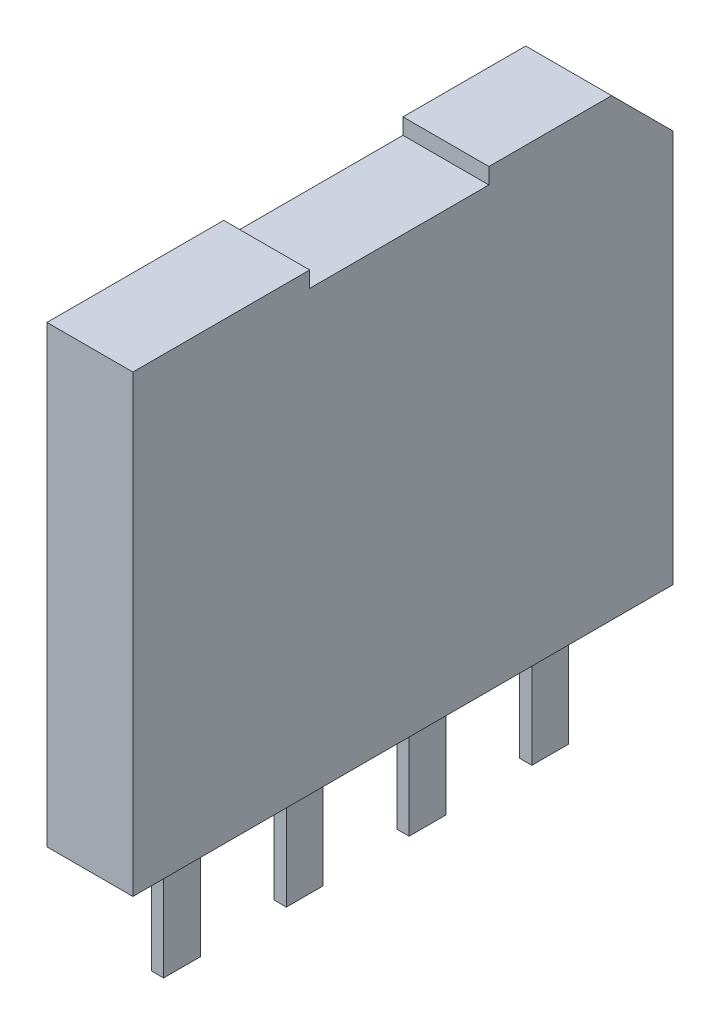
ISO-10303-21;
HEADER;
FILE_DESCRIPTION(('STEP AP214'),'2;1');
FILE_NAME('part.step','',(''),(''),'','','');
FILE_SCHEMA(('AUTOMOTIVE_DESIGN { 1 0 10303 214 1 1 1 1 }'));
ENDSEC;
DATA;
#1=APPLICATION_CONTEXT('core data for automotive mechanical design processes');
#2=APPLICATION_PROTOCOL_DEFINITION('international standard','automotive_design',2000,#1);
#3=PRODUCT_CONTEXT('',#1,'mechanical');
#4=PRODUCT('Part','Part','',(#3));
#5=PRODUCT_RELATED_PRODUCT_CATEGORY('part','',(#4));
#6=PRODUCT_DEFINITION_FORMATION('','',#4);
#7=PRODUCT_DEFINITION_CONTEXT('part definition',#1,'design');
#8=PRODUCT_DEFINITION('design','',#6,#7);
#9=PRODUCT_DEFINITION_SHAPE('','',#8);
#10=(LENGTH_UNIT() NAMED_UNIT(*) SI_UNIT(.MILLI.,.METRE.));
#11=(NAMED_UNIT(*) PLANE_ANGLE_UNIT() SI_UNIT($,.RADIAN.));
#12=(NAMED_UNIT(*) SI_UNIT($,.STERADIAN.) SOLID_ANGLE_UNIT());
#13=UNCERTAINTY_MEASURE_WITH_UNIT(LENGTH_MEASURE(1.E-05),#10,'distance_accuracy_value','');
#14=(GEOMETRIC_REPRESENTATION_CONTEXT(3) GLOBAL_UNCERTAINTY_ASSIGNED_CONTEXT((#13)) GLOBAL_UNIT_ASSIGNED_CONTEXT((#10,
#11,#12)) REPRESENTATION_CONTEXT('',''));
#15=CARTESIAN_POINT('',(0.,0.,0.));
#16=DIRECTION('',(0.,0.,1.));
#17=DIRECTION('',(1.,0.,0.));
#18=AXIS2_PLACEMENT_3D('',#15,#16,#17);
#19=CARTESIAN_POINT('',(1.75,0.,11.));
#20=DIRECTION('',(0.,0.,-1.));
#21=DIRECTION('',(-1.,0.,0.));
#22=AXIS2_PLACEMENT_3D('',#19,#20,#21);
#23=PLANE('',#22);
#24=DIRECTION('',(0.,-1.,0.));
#25=VECTOR('',#24,1.);
#26=CARTESIAN_POINT('',(-1.75,0.,11.));
#27=LINE('',#26,#25);
#28=CARTESIAN_POINT('',(-1.75,18.5,11.));
#29=VERTEX_POINT('',#28);
#30=CARTESIAN_POINT('',(-1.75,0.,11.));
#31=VERTEX_POINT('',#30);
#32=EDGE_CURVE('E11',#29,#31,#27,.T.);
#33=ORIENTED_EDGE('',*,*,#32,.T.);
#34=DIRECTION('',(-1.,0.,0.));
#35=VECTOR('',#34,1.);
#36=CARTESIAN_POINT('',(1.75,0.,11.));
#37=LINE('',#36,#35);
#38=CARTESIAN_POINT('',(1.75,0.,11.));
#39=VERTEX_POINT('',#38);
#40=EDGE_CURVE('E36',#39,#31,#37,.T.);
#41=ORIENTED_EDGE('',*,*,#40,.F.);
#42=DIRECTION('',(0.,-1.,0.));
#43=VECTOR('',#42,1.);
#44=CARTESIAN_POINT('',(1.75,0.,11.));
#45=LINE('',#44,#43);
#46=CARTESIAN_POINT('',(1.75,18.5,11.));
#47=VERTEX_POINT('',#46);
#48=EDGE_CURVE('E264',#47,#39,#45,.T.);
#49=ORIENTED_EDGE('',*,*,#48,.F.);
#50=DIRECTION('',(-1.,0.,0.));
#51=VECTOR('',#50,1.);
#52=CARTESIAN_POINT('',(1.75,18.5,11.));
#53=LINE('',#52,#51);
#54=EDGE_CURVE('E27',#47,#29,#53,.T.);
#55=ORIENTED_EDGE('',*,*,#54,.T.);
#56=EDGE_LOOP('',(#33,#41,#49,#55));
#57=FACE_BOUND('',#56,.T.);
#58=ADVANCED_FACE('F17',(#57),#23,.F.);
#59=CARTESIAN_POINT('',(1.75,0.,11.));
#60=DIRECTION('',(0.,1.,0.));
#61=DIRECTION('',(0.,0.,1.));
#62=AXIS2_PLACEMENT_3D('',#59,#60,#61);
#63=PLANE('',#62);
#64=DIRECTION('',(-1.,0.,0.));
#65=VECTOR('',#64,1.);
#66=CARTESIAN_POINT('',(0.25,0.,-6.75));
#67=LINE('',#66,#65);
#68=CARTESIAN_POINT('',(0.25,0.,-6.75));
#69=VERTEX_POINT('',#68);
#70=CARTESIAN_POINT('',(-0.25,0.,-6.75));
#71=VERTEX_POINT('',#70);
#72=EDGE_CURVE('E210',#69,#71,#67,.T.);
#73=ORIENTED_EDGE('',*,*,#72,.F.);
#74=DIRECTION('',(0.,0.,1.));
#75=VECTOR('',#74,1.);
#76=CARTESIAN_POINT('',(0.25,0.,-6.75));
#77=LINE('',#76,#75);
#78=CARTESIAN_POINT('',(0.25,0.,-8.25));
#79=VERTEX_POINT('',#78);
#80=EDGE_CURVE('E205',#79,#69,#77,.T.);
#81=ORIENTED_EDGE('',*,*,#80,.F.);
#82=DIRECTION('',(-1.,0.,0.));
#83=VECTOR('',#82,1.);
#84=CARTESIAN_POINT('',(0.25,0.,-8.25));
#85=LINE('',#84,#83);
#86=CARTESIAN_POINT('',(-0.25,0.,-8.25));
#87=VERTEX_POINT('',#86);
#88=EDGE_CURVE('E204',#79,#87,#85,.T.);
#89=ORIENTED_EDGE('',*,*,#88,.T.);
#90=DIRECTION('',(0.,0.,1.));
#91=VECTOR('',#90,1.);
#92=CARTESIAN_POINT('',(-0.25,0.,-6.75));
#93=LINE('',#92,#91);
#94=EDGE_CURVE('E213',#87,#71,#93,.T.);
#95=ORIENTED_EDGE('',*,*,#94,.T.);
#96=EDGE_LOOP('',(#73,#81,#89,#95));
#97=FACE_BOUND('',#96,.T.);
#98=DIRECTION('',(-1.,0.,0.));
#99=VECTOR('',#98,1.);
#100=CARTESIAN_POINT('',(0.25,0.,-1.75));
#101=LINE('',#100,#99);
#102=CARTESIAN_POINT('',(0.25,0.,-1.75));
#103=VERTEX_POINT('',#102);
#104=CARTESIAN_POINT('',(-0.25,0.,-1.75));
#105=VERTEX_POINT('',#104);
#106=EDGE_CURVE('E217',#103,#105,#101,.T.);
#107=ORIENTED_EDGE('',*,*,#106,.F.);
#108=DIRECTION('',(0.,0.,1.));
#109=VECTOR('',#108,1.);
#110=CARTESIAN_POINT('',(0.25,0.,-1.75));
#111=LINE('',#110,#109);
#112=CARTESIAN_POINT('',(0.25,0.,-3.25));
#113=VERTEX_POINT('',#112);
#114=EDGE_CURVE('E221',#113,#103,#111,.T.);
#115=ORIENTED_EDGE('',*,*,#114,.F.);
#116=DIRECTION('',(-1.,0.,0.));
#117=VECTOR('',#116,1.);
#118=CARTESIAN_POINT('',(0.25,0.,-3.25));
#119=LINE('',#118,#117);
#120=CARTESIAN_POINT('',(-0.25,0.,-3.25));
#121=VERTEX_POINT('',#120);
#122=EDGE_CURVE('E216',#113,#121,#119,.T.);
#123=ORIENTED_EDGE('',*,*,#122,.T.);
#124=DIRECTION('',(0.,0.,1.));
#125=VECTOR('',#124,1.);
#126=CARTESIAN_POINT('',(-0.25,0.,-1.75));
#127=LINE('',#126,#125);
#128=EDGE_CURVE('E227',#121,#105,#127,.T.);
#129=ORIENTED_EDGE('',*,*,#128,.T.);
#130=EDGE_LOOP('',(#107,#115,#123,#129));
#131=FACE_BOUND('',#130,.T.);
#132=DIRECTION('',(-1.,0.,0.));
#133=VECTOR('',#132,1.);
#134=CARTESIAN_POINT('',(0.25,0.,3.25));
#135=LINE('',#134,#133);
#136=CARTESIAN_POINT('',(0.25,0.,3.25));
#137=VERTEX_POINT('',#136);
#138=CARTESIAN_POINT('',(-0.25,0.,3.25));
#139=VERTEX_POINT('',#138);
#140=EDGE_CURVE('E231',#137,#139,#135,.T.);
#141=ORIENTED_EDGE('',*,*,#140,.F.);
#142=DIRECTION('',(0.,0.,1.));
#143=VECTOR('',#142,1.);
#144=CARTESIAN_POINT('',(0.25,0.,3.25));
#145=LINE('',#144,#143);
#146=CARTESIAN_POINT('',(0.25,0.,1.75));
#147=VERTEX_POINT('',#146);
#148=EDGE_CURVE('E235',#147,#137,#145,.T.);
#149=ORIENTED_EDGE('',*,*,#148,.F.);
#150=DIRECTION('',(-1.,0.,0.));
#151=VECTOR('',#150,1.);
#152=CARTESIAN_POINT('',(0.25,0.,1.75));
#153=LINE('',#152,#151);
#154=CARTESIAN_POINT('',(-0.25,0.,1.75));
#155=VERTEX_POINT('',#154);
#156=EDGE_CURVE('E230',#147,#155,#153,.T.);
#157=ORIENTED_EDGE('',*,*,#156,.T.);
#158=DIRECTION('',(0.,0.,1.));
#159=VECTOR('',#158,1.);
#160=CARTESIAN_POINT('',(-0.25,0.,3.25));
#161=LINE('',#160,#159);
#162=EDGE_CURVE('E240',#155,#139,#161,.T.);
#163=ORIENTED_EDGE('',*,*,#162,.T.);
#164=EDGE_LOOP('',(#141,#149,#157,#163));
#165=FACE_BOUND('',#164,.T.);
#166=DIRECTION('',(-1.,0.,0.));
#167=VECTOR('',#166,1.);
#168=CARTESIAN_POINT('',(0.25,0.,8.25));
#169=LINE('',#168,#167);
#170=CARTESIAN_POINT('',(0.25,0.,8.25));
#171=VERTEX_POINT('',#170);
#172=CARTESIAN_POINT('',(-0.25,0.,8.25));
#173=VERTEX_POINT('',#172);
#174=EDGE_CURVE('E244',#171,#173,#169,.T.);
#175=ORIENTED_EDGE('',*,*,#174,.F.);
#176=DIRECTION('',(0.,0.,1.));
#177=VECTOR('',#176,1.);
#178=CARTESIAN_POINT('',(0.25,0.,8.25));
#179=LINE('',#178,#177);
#180=CARTESIAN_POINT('',(0.25,0.,6.75));
#181=VERTEX_POINT('',#180);
#182=EDGE_CURVE('E248',#181,#171,#179,.T.);
#183=ORIENTED_EDGE('',*,*,#182,.F.);
#184=DIRECTION('',(-1.,0.,0.));
#185=VECTOR('',#184,1.);
#186=CARTESIAN_POINT('',(0.25,0.,6.75));
#187=LINE('',#186,#185);
#188=CARTESIAN_POINT('',(-0.25,0.,6.75));
#189=VERTEX_POINT('',#188);
#190=EDGE_CURVE('E243',#181,#189,#187,.T.);
#191=ORIENTED_EDGE('',*,*,#190,.T.);
#192=DIRECTION('',(0.,0.,1.));
#193=VECTOR('',#192,1.);
#194=CARTESIAN_POINT('',(-0.25,0.,8.25));
#195=LINE('',#194,#193);
#196=EDGE_CURVE('E253',#189,#173,#195,.T.);
#197=ORIENTED_EDGE('',*,*,#196,.T.);
#198=EDGE_LOOP('',(#175,#183,#191,#197));
#199=FACE_BOUND('',#198,.T.);
#200=DIRECTION('',(0.,0.,-1.));
#201=VECTOR('',#200,1.);
#202=CARTESIAN_POINT('',(-1.75,0.,11.));
#203=LINE('',#202,#201);
#204=CARTESIAN_POINT('',(-1.75,0.,-11.));
#205=VERTEX_POINT('',#204);
#206=EDGE_CURVE('E256',#31,#205,#203,.T.);
#207=ORIENTED_EDGE('',*,*,#206,.T.);
#208=DIRECTION('',(-1.,0.,0.));
#209=VECTOR('',#208,1.);
#210=CARTESIAN_POINT('',(1.75,0.,-11.));
#211=LINE('',#210,#209);
#212=CARTESIAN_POINT('',(1.75,0.,-11.));
#213=VERTEX_POINT('',#212);
#214=EDGE_CURVE('E258',#213,#205,#211,.T.);
#215=ORIENTED_EDGE('',*,*,#214,.F.);
#216=DIRECTION('',(0.,0.,-1.));
#217=VECTOR('',#216,1.);
#218=CARTESIAN_POINT('',(1.75,0.,11.));
#219=LINE('',#218,#217);
#220=EDGE_CURVE('E262',#39,#213,#219,.T.);
#221=ORIENTED_EDGE('',*,*,#220,.F.);
#222=ORIENTED_EDGE('',*,*,#40,.T.);
#223=EDGE_LOOP('',(#207,#215,#221,#222));
#224=FACE_BOUND('',#223,.T.);
#225=ADVANCED_FACE('F370',(#97,#131,#165,#199,#224),#63,.F.);
#226=CARTESIAN_POINT('',(1.75,0.,-11.));
#227=DIRECTION('',(0.,0.,1.));
#228=DIRECTION('',(1.,0.,0.));
#229=AXIS2_PLACEMENT_3D('',#226,#227,#228);
#230=PLANE('',#229);
#231=DIRECTION('',(0.,1.,0.));
#232=VECTOR('',#231,1.);
#233=CARTESIAN_POINT('',(-1.75,0.,-11.));
#234=LINE('',#233,#232);
#235=CARTESIAN_POINT('',(-1.75,16.,-11.));
#236=VERTEX_POINT('',#235);
#237=EDGE_CURVE('E260',#205,#236,#234,.T.);
#238=ORIENTED_EDGE('',*,*,#237,.T.);
#239=DIRECTION('',(-1.,0.,0.));
#240=VECTOR('',#239,1.);
#241=CARTESIAN_POINT('',(1.75,16.,-11.));
#242=LINE('',#241,#240);
#243=CARTESIAN_POINT('',(1.75,16.,-11.));
#244=VERTEX_POINT('',#243);
#245=EDGE_CURVE('E268',#244,#236,#242,.T.);
#246=ORIENTED_EDGE('',*,*,#245,.F.);
#247=DIRECTION('',(0.,1.,0.));
#248=VECTOR('',#247,1.);
#249=CARTESIAN_POINT('',(1.75,0.,-11.));
#250=LINE('',#249,#248);
#251=EDGE_CURVE('E265',#213,#244,#250,.T.);
#252=ORIENTED_EDGE('',*,*,#251,.F.);
#253=ORIENTED_EDGE('',*,*,#214,.T.);
#254=EDGE_LOOP('',(#238,#246,#252,#253));
#255=FACE_BOUND('',#254,.T.);
#256=ADVANCED_FACE('F392',(#255),#230,.F.);
#257=CARTESIAN_POINT('',(1.75,18.5,-8.5));
#258=DIRECTION('',(0.,-0.707106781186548,0.707106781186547));
#259=DIRECTION('',(0.,-0.707106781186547,-0.707106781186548));
#260=AXIS2_PLACEMENT_3D('',#257,#258,#259);
#261=PLANE('',#260);
#262=DIRECTION('',(0.,0.707106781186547,0.707106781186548));
#263=VECTOR('',#262,1.);
#264=CARTESIAN_POINT('',(-1.75,18.5,-8.5));
#265=LINE('',#264,#263);
#266=CARTESIAN_POINT('',(-1.75,18.5,-8.5));
#267=VERTEX_POINT('',#266);
#268=EDGE_CURVE('E261',#236,#267,#265,.T.);
#269=ORIENTED_EDGE('',*,*,#268,.T.);
#270=DIRECTION('',(-1.,0.,0.));
#271=VECTOR('',#270,1.);
#272=CARTESIAN_POINT('',(1.75,18.5,-8.5));
#273=LINE('',#272,#271);
#274=CARTESIAN_POINT('',(1.75,18.5,-8.5));
#275=VERTEX_POINT('',#274);
#276=EDGE_CURVE('E275',#275,#267,#273,.T.);
#277=ORIENTED_EDGE('',*,*,#276,.F.);
#278=DIRECTION('',(0.,0.707106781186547,0.707106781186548));
#279=VECTOR('',#278,1.);
#280=CARTESIAN_POINT('',(1.75,18.5,-8.5));
#281=LINE('',#280,#279);
#282=EDGE_CURVE('E272',#244,#275,#281,.T.);
#283=ORIENTED_EDGE('',*,*,#282,.F.);
#284=ORIENTED_EDGE('',*,*,#245,.T.);
#285=EDGE_LOOP('',(#269,#277,#283,#284));
#286=FACE_BOUND('',#285,.T.);
#287=ADVANCED_FACE('F397',(#286),#261,.F.);
#288=CARTESIAN_POINT('',(1.75,18.5,-3.5));
#289=DIRECTION('',(0.,-1.,0.));
#290=DIRECTION('',(0.,0.,-1.));
#291=AXIS2_PLACEMENT_3D('',#288,#289,#290);
#292=PLANE('',#291);
#293=DIRECTION('',(0.,0.,1.));
#294=VECTOR('',#293,1.);
#295=CARTESIAN_POINT('',(-1.75,18.5,-3.5));
#296=LINE('',#295,#294);
#297=CARTESIAN_POINT('',(-1.75,18.5,-3.5));
#298=VERTEX_POINT('',#297);
#299=EDGE_CURVE('E270',#267,#298,#296,.T.);
#300=ORIENTED_EDGE('',*,*,#299,.T.);
#301=DIRECTION('',(-1.,0.,0.));
#302=VECTOR('',#301,1.);
#303=CARTESIAN_POINT('',(1.75,18.5,-3.5));
#304=LINE('',#303,#302);
#305=CARTESIAN_POINT('',(1.75,18.5,-3.5));
#306=VERTEX_POINT('',#305);
#307=EDGE_CURVE('E282',#306,#298,#304,.T.);
#308=ORIENTED_EDGE('',*,*,#307,.F.);
#309=DIRECTION('',(0.,0.,1.));
#310=VECTOR('',#309,1.);
#311=CARTESIAN_POINT('',(1.75,18.5,-3.5));
#312=LINE('',#311,#310);
#313=EDGE_CURVE('E279',#275,#306,#312,.T.);
#314=ORIENTED_EDGE('',*,*,#313,.F.);
#315=ORIENTED_EDGE('',*,*,#276,.T.);
#316=EDGE_LOOP('',(#300,#308,#314,#315));
#317=FACE_BOUND('',#316,.T.);
#318=ADVANCED_FACE('F401',(#317),#292,.F.);
#319=CARTESIAN_POINT('',(1.75,17.85,-3.5));
#320=DIRECTION('',(0.,0.,-1.));
#321=DIRECTION('',(-1.,0.,0.));
#322=AXIS2_PLACEMENT_3D('',#319,#320,#321);
#323=PLANE('',#322);
#324=DIRECTION('',(0.,-1.,0.));
#325=VECTOR('',#324,1.);
#326=CARTESIAN_POINT('',(-1.75,17.85,-3.5));
#327=LINE('',#326,#325);
#328=CARTESIAN_POINT('',(-1.75,17.85,-3.5));
#329=VERTEX_POINT('',#328);
#330=EDGE_CURVE('E277',#298,#329,#327,.T.);
#331=ORIENTED_EDGE('',*,*,#330,.T.);
#332=DIRECTION('',(-1.,0.,0.));
#333=VECTOR('',#332,1.);
#334=CARTESIAN_POINT('',(1.75,17.85,-3.5));
#335=LINE('',#334,#333);
#336=CARTESIAN_POINT('',(1.75,17.85,-3.5));
#337=VERTEX_POINT('',#336);
#338=EDGE_CURVE('E289',#337,#329,#335,.T.);
#339=ORIENTED_EDGE('',*,*,#338,.F.);
#340=DIRECTION('',(0.,-1.,0.));
#341=VECTOR('',#340,1.);
#342=CARTESIAN_POINT('',(1.75,17.85,-3.5));
#343=LINE('',#342,#341);
#344=EDGE_CURVE('E286',#306,#337,#343,.T.);
#345=ORIENTED_EDGE('',*,*,#344,.F.);
#346=ORIENTED_EDGE('',*,*,#307,.T.);
#347=EDGE_LOOP('',(#331,#339,#345,#346));
#348=FACE_BOUND('',#347,.T.);
#349=ADVANCED_FACE('F405',(#348),#323,.F.);
#350=CARTESIAN_POINT('',(1.75,17.85,3.8));
#351=DIRECTION('',(0.,-1.,0.));
#352=DIRECTION('',(0.,0.,-1.));
#353=AXIS2_PLACEMENT_3D('',#350,#351,#352);
#354=PLANE('',#353);
#355=DIRECTION('',(0.,0.,1.));
#356=VECTOR('',#355,1.);
#357=CARTESIAN_POINT('',(-1.75,17.85,3.8));
#358=LINE('',#357,#356);
#359=CARTESIAN_POINT('',(-1.75,17.85,3.8));
#360=VERTEX_POINT('',#359);
#361=EDGE_CURVE('E284',#329,#360,#358,.T.);
#362=ORIENTED_EDGE('',*,*,#361,.T.);
#363=DIRECTION('',(-1.,0.,0.));
#364=VECTOR('',#363,1.);
#365=CARTESIAN_POINT('',(1.75,17.85,3.8));
#366=LINE('',#365,#364);
#367=CARTESIAN_POINT('',(1.75,17.85,3.8));
#368=VERTEX_POINT('',#367);
#369=EDGE_CURVE('E296',#368,#360,#366,.T.);
#370=ORIENTED_EDGE('',*,*,#369,.F.);
#371=DIRECTION('',(0.,0.,1.));
#372=VECTOR('',#371,1.);
#373=CARTESIAN_POINT('',(1.75,17.85,3.8));
#374=LINE('',#373,#372);
#375=EDGE_CURVE('E293',#337,#368,#374,.T.);
#376=ORIENTED_EDGE('',*,*,#375,.F.);
#377=ORIENTED_EDGE('',*,*,#338,.T.);
#378=EDGE_LOOP('',(#362,#370,#376,#377));
#379=FACE_BOUND('',#378,.T.);
#380=ADVANCED_FACE('F409',(#379),#354,.F.);
#381=CARTESIAN_POINT('',(1.75,18.5,3.8));
#382=DIRECTION('',(0.,0.,1.));
#383=DIRECTION('',(0.,-1.,0.));
#384=AXIS2_PLACEMENT_3D('',#381,#382,#383);
#385=PLANE('',#384);
#386=DIRECTION('',(0.,1.,0.));
#387=VECTOR('',#386,1.);
#388=CARTESIAN_POINT('',(-1.75,18.5,3.8));
#389=LINE('',#388,#387);
#390=CARTESIAN_POINT('',(-1.75,18.5,3.8));
#391=VERTEX_POINT('',#390);
#392=EDGE_CURVE('E291',#360,#391,#389,.T.);
#393=ORIENTED_EDGE('',*,*,#392,.T.);
#394=DIRECTION('',(-1.,0.,0.));
#395=VECTOR('',#394,1.);
#396=CARTESIAN_POINT('',(1.75,18.5,3.8));
#397=LINE('',#396,#395);
#398=CARTESIAN_POINT('',(1.75,18.5,3.8));
#399=VERTEX_POINT('',#398);
#400=EDGE_CURVE('E303',#399,#391,#397,.T.);
#401=ORIENTED_EDGE('',*,*,#400,.F.);
#402=DIRECTION('',(0.,1.,0.));
#403=VECTOR('',#402,1.);
#404=CARTESIAN_POINT('',(1.75,18.5,3.8));
#405=LINE('',#404,#403);
#406=EDGE_CURVE('E300',#368,#399,#405,.T.);
#407=ORIENTED_EDGE('',*,*,#406,.F.);
#408=ORIENTED_EDGE('',*,*,#369,.T.);
#409=EDGE_LOOP('',(#393,#401,#407,#408));
#410=FACE_BOUND('',#409,.T.);
#411=ADVANCED_FACE('F413',(#410),#385,.F.);
#412=CARTESIAN_POINT('',(1.75,18.5,11.));
#413=DIRECTION('',(0.,-1.,0.));
#414=DIRECTION('',(0.,0.,-1.));
#415=AXIS2_PLACEMENT_3D('',#412,#413,#414);
#416=PLANE('',#415);
#417=DIRECTION('',(0.,0.,1.));
#418=VECTOR('',#417,1.);
#419=CARTESIAN_POINT('',(-1.75,18.5,11.));
#420=LINE('',#419,#418);
#421=EDGE_CURVE('E298',#391,#29,#420,.T.);
#422=ORIENTED_EDGE('',*,*,#421,.T.);
#423=ORIENTED_EDGE('',*,*,#54,.F.);
#424=DIRECTION('',(0.,0.,1.));
#425=VECTOR('',#424,1.);
#426=CARTESIAN_POINT('',(1.75,18.5,11.));
#427=LINE('',#426,#425);
#428=EDGE_CURVE('E306',#399,#47,#427,.T.);
#429=ORIENTED_EDGE('',*,*,#428,.F.);
#430=ORIENTED_EDGE('',*,*,#400,.T.);
#431=EDGE_LOOP('',(#422,#423,#429,#430));
#432=FACE_BOUND('',#431,.T.);
#433=ADVANCED_FACE('F417',(#432),#416,.F.);
#434=CARTESIAN_POINT('',(1.75,18.5,11.));
#435=DIRECTION('',(-1.,0.,0.));
#436=DIRECTION('',(0.,0.,1.));
#437=AXIS2_PLACEMENT_3D('',#434,#435,#436);
#438=PLANE('',#437);
#439=ORIENTED_EDGE('',*,*,#48,.T.);
#440=ORIENTED_EDGE('',*,*,#220,.T.);
#441=ORIENTED_EDGE('',*,*,#251,.T.);
#442=ORIENTED_EDGE('',*,*,#282,.T.);
#443=ORIENTED_EDGE('',*,*,#313,.T.);
#444=ORIENTED_EDGE('',*,*,#344,.T.);
#445=ORIENTED_EDGE('',*,*,#375,.T.);
#446=ORIENTED_EDGE('',*,*,#406,.T.);
#447=ORIENTED_EDGE('',*,*,#428,.T.);
#448=EDGE_LOOP('',(#439,#440,#441,#442,#443,#444,#445,#446,#447));
#449=FACE_BOUND('',#448,.T.);
#450=ADVANCED_FACE('F421',(#449),#438,.F.);
#451=CARTESIAN_POINT('',(-1.75,18.5,11.));
#452=DIRECTION('',(-1.,0.,0.));
#453=DIRECTION('',(0.,0.,1.));
#454=AXIS2_PLACEMENT_3D('',#451,#452,#453);
#455=PLANE('',#454);
#456=ORIENTED_EDGE('',*,*,#32,.F.);
#457=ORIENTED_EDGE('',*,*,#421,.F.);
#458=ORIENTED_EDGE('',*,*,#392,.F.);
#459=ORIENTED_EDGE('',*,*,#361,.F.);
#460=ORIENTED_EDGE('',*,*,#330,.F.);
#461=ORIENTED_EDGE('',*,*,#299,.F.);
#462=ORIENTED_EDGE('',*,*,#268,.F.);
#463=ORIENTED_EDGE('',*,*,#237,.F.);
#464=ORIENTED_EDGE('',*,*,#206,.F.);
#465=EDGE_LOOP('',(#456,#457,#458,#459,#460,#461,#462,#463,#464));
#466=FACE_BOUND('',#465,.T.);
#467=ADVANCED_FACE('F425',(#466),#455,.T.);
#468=CARTESIAN_POINT('',(0.25,0.,8.25));
#469=DIRECTION('',(0.,0.,-1.));
#470=DIRECTION('',(0.,1.,0.));
#471=AXIS2_PLACEMENT_3D('',#468,#469,#470);
#472=PLANE('',#471);
#473=DIRECTION('',(0.,-1.,0.));
#474=VECTOR('',#473,1.);
#475=CARTESIAN_POINT('',(-0.25,0.,8.25));
#476=LINE('',#475,#474);
#477=CARTESIAN_POINT('',(-0.25,-5.,8.25));
#478=VERTEX_POINT('',#477);
#479=EDGE_CURVE('E246',#173,#478,#476,.T.);
#480=ORIENTED_EDGE('',*,*,#479,.T.);
#481=DIRECTION('',(-1.,0.,0.));
#482=VECTOR('',#481,1.);
#483=CARTESIAN_POINT('',(0.25,-5.,8.25));
#484=LINE('',#483,#482);
#485=CARTESIAN_POINT('',(0.25,-5.,8.25));
#486=VERTEX_POINT('',#485);
#487=EDGE_CURVE('E313',#486,#478,#484,.T.);
#488=ORIENTED_EDGE('',*,*,#487,.F.);
#489=DIRECTION('',(0.,-1.,0.));
#490=VECTOR('',#489,1.);
#491=CARTESIAN_POINT('',(0.25,0.,8.25));
#492=LINE('',#491,#490);
#493=EDGE_CURVE('E316',#171,#486,#492,.T.);
#494=ORIENTED_EDGE('',*,*,#493,.F.);
#495=ORIENTED_EDGE('',*,*,#174,.T.);
#496=EDGE_LOOP('',(#480,#488,#494,#495));
#497=FACE_BOUND('',#496,.T.);
#498=ADVANCED_FACE('F429',(#497),#472,.F.);
#499=CARTESIAN_POINT('',(0.25,-5.,8.25));
#500=DIRECTION('',(0.,1.,0.));
#501=DIRECTION('',(0.,0.,1.));
#502=AXIS2_PLACEMENT_3D('',#499,#500,#501);
#503=PLANE('',#502);
#504=DIRECTION('',(0.,0.,-1.));
#505=VECTOR('',#504,1.);
#506=CARTESIAN_POINT('',(-0.25,-5.,8.25));
#507=LINE('',#506,#505);
#508=CARTESIAN_POINT('',(-0.25,-5.,6.75));
#509=VERTEX_POINT('',#508);
#510=EDGE_CURVE('E247',#478,#509,#507,.T.);
#511=ORIENTED_EDGE('',*,*,#510,.T.);
#512=DIRECTION('',(-1.,0.,0.));
#513=VECTOR('',#512,1.);
#514=CARTESIAN_POINT('',(0.25,-5.,6.75));
#515=LINE('',#514,#513);
#516=CARTESIAN_POINT('',(0.25,-5.,6.75));
#517=VERTEX_POINT('',#516);
#518=EDGE_CURVE('E318',#517,#509,#515,.T.);
#519=ORIENTED_EDGE('',*,*,#518,.F.);
#520=DIRECTION('',(0.,0.,-1.));
#521=VECTOR('',#520,1.);
#522=CARTESIAN_POINT('',(0.25,-5.,8.25));
#523=LINE('',#522,#521);
#524=EDGE_CURVE('E319',#486,#517,#523,.T.);
#525=ORIENTED_EDGE('',*,*,#524,.F.);
#526=ORIENTED_EDGE('',*,*,#487,.T.);
#527=EDGE_LOOP('',(#511,#519,#525,#526));
#528=FACE_BOUND('',#527,.T.);
#529=ADVANCED_FACE('F433',(#528),#503,.F.);
#530=CARTESIAN_POINT('',(0.25,0.,6.75));
#531=DIRECTION('',(0.,0.,1.));
#532=DIRECTION('',(0.,-1.,0.));
#533=AXIS2_PLACEMENT_3D('',#530,#531,#532);
#534=PLANE('',#533);
#535=DIRECTION('',(0.,1.,0.));
#536=VECTOR('',#535,1.);
#537=CARTESIAN_POINT('',(-0.25,0.,6.75));
#538=LINE('',#537,#536);
#539=EDGE_CURVE('E315',#509,#189,#538,.T.);
#540=ORIENTED_EDGE('',*,*,#539,.T.);
#541=ORIENTED_EDGE('',*,*,#190,.F.);
#542=DIRECTION('',(0.,1.,0.));
#543=VECTOR('',#542,1.);
#544=CARTESIAN_POINT('',(0.25,0.,6.75));
#545=LINE('',#544,#543);
#546=EDGE_CURVE('E250',#517,#181,#545,.T.);
#547=ORIENTED_EDGE('',*,*,#546,.F.);
#548=ORIENTED_EDGE('',*,*,#518,.T.);
#549=EDGE_LOOP('',(#540,#541,#547,#548));
#550=FACE_BOUND('',#549,.T.);
#551=ADVANCED_FACE('F437',(#550),#534,.F.);
#552=CARTESIAN_POINT('',(0.25,0.,8.25));
#553=DIRECTION('',(1.,0.,0.));
#554=DIRECTION('',(0.,0.,-1.));
#555=AXIS2_PLACEMENT_3D('',#552,#553,#554);
#556=PLANE('',#555);
#557=ORIENTED_EDGE('',*,*,#493,.T.);
#558=ORIENTED_EDGE('',*,*,#524,.T.);
#559=ORIENTED_EDGE('',*,*,#546,.T.);
#560=ORIENTED_EDGE('',*,*,#182,.T.);
#561=EDGE_LOOP('',(#557,#558,#559,#560));
#562=FACE_BOUND('',#561,.T.);
#563=ADVANCED_FACE('F441',(#562),#556,.T.);
#564=CARTESIAN_POINT('',(-0.25,0.,8.25));
#565=DIRECTION('',(1.,0.,0.));
#566=DIRECTION('',(0.,0.,-1.));
#567=AXIS2_PLACEMENT_3D('',#564,#565,#566);
#568=PLANE('',#567);
#569=ORIENTED_EDGE('',*,*,#479,.F.);
#570=ORIENTED_EDGE('',*,*,#196,.F.);
#571=ORIENTED_EDGE('',*,*,#539,.F.);
#572=ORIENTED_EDGE('',*,*,#510,.F.);
#573=EDGE_LOOP('',(#569,#570,#571,#572));
#574=FACE_BOUND('',#573,.T.);
#575=ADVANCED_FACE('F445',(#574),#568,.F.);
#576=CARTESIAN_POINT('',(0.25,0.,3.25));
#577=DIRECTION('',(0.,0.,-1.));
#578=DIRECTION('',(0.,1.,0.));
#579=AXIS2_PLACEMENT_3D('',#576,#577,#578);
#580=PLANE('',#579);
#581=DIRECTION('',(0.,-1.,0.));
#582=VECTOR('',#581,1.);
#583=CARTESIAN_POINT('',(-0.25,0.,3.25));
#584=LINE('',#583,#582);
#585=CARTESIAN_POINT('',(-0.25,-5.,3.25));
#586=VERTEX_POINT('',#585);
#587=EDGE_CURVE('E233',#139,#586,#584,.T.);
#588=ORIENTED_EDGE('',*,*,#587,.T.);
#589=DIRECTION('',(-1.,0.,0.));
#590=VECTOR('',#589,1.);
#591=CARTESIAN_POINT('',(0.25,-5.,3.25));
#592=LINE('',#591,#590);
#593=CARTESIAN_POINT('',(0.25,-5.,3.25));
#594=VERTEX_POINT('',#593);
#595=EDGE_CURVE('E330',#594,#586,#592,.T.);
#596=ORIENTED_EDGE('',*,*,#595,.F.);
#597=DIRECTION('',(0.,-1.,0.));
#598=VECTOR('',#597,1.);
#599=CARTESIAN_POINT('',(0.25,0.,3.25));
#600=LINE('',#599,#598);
#601=EDGE_CURVE('E333',#137,#594,#600,.T.);
#602=ORIENTED_EDGE('',*,*,#601,.F.);
#603=ORIENTED_EDGE('',*,*,#140,.T.);
#604=EDGE_LOOP('',(#588,#596,#602,#603));
#605=FACE_BOUND('',#604,.T.);
#606=ADVANCED_FACE('F449',(#605),#580,.F.);
#607=CARTESIAN_POINT('',(0.25,-5.,3.25));
#608=DIRECTION('',(0.,1.,0.));
#609=DIRECTION('',(0.,0.,1.));
#610=AXIS2_PLACEMENT_3D('',#607,#608,#609);
#611=PLANE('',#610);
#612=DIRECTION('',(0.,0.,-1.));
#613=VECTOR('',#612,1.);
#614=CARTESIAN_POINT('',(-0.25,-5.,3.25));
#615=LINE('',#614,#613);
#616=CARTESIAN_POINT('',(-0.25,-5.,1.75));
#617=VERTEX_POINT('',#616);
#618=EDGE_CURVE('E234',#586,#617,#615,.T.);
#619=ORIENTED_EDGE('',*,*,#618,.T.);
#620=DIRECTION('',(-1.,0.,0.));
#621=VECTOR('',#620,1.);
#622=CARTESIAN_POINT('',(0.25,-5.,1.75));
#623=LINE('',#622,#621);
#624=CARTESIAN_POINT('',(0.25,-5.,1.75));
#625=VERTEX_POINT('',#624);
#626=EDGE_CURVE('E335',#625,#617,#623,.T.);
#627=ORIENTED_EDGE('',*,*,#626,.F.);
#628=DIRECTION('',(0.,0.,-1.));
#629=VECTOR('',#628,1.);
#630=CARTESIAN_POINT('',(0.25,-5.,3.25));
#631=LINE('',#630,#629);
#632=EDGE_CURVE('E336',#594,#625,#631,.T.);
#633=ORIENTED_EDGE('',*,*,#632,.F.);
#634=ORIENTED_EDGE('',*,*,#595,.T.);
#635=EDGE_LOOP('',(#619,#627,#633,#634));
#636=FACE_BOUND('',#635,.T.);
#637=ADVANCED_FACE('F453',(#636),#611,.F.);
#638=CARTESIAN_POINT('',(0.25,0.,1.75));
#639=DIRECTION('',(0.,0.,1.));
#640=DIRECTION('',(0.,-1.,0.));
#641=AXIS2_PLACEMENT_3D('',#638,#639,#640);
#642=PLANE('',#641);
#643=DIRECTION('',(0.,1.,0.));
#644=VECTOR('',#643,1.);
#645=CARTESIAN_POINT('',(-0.25,0.,1.75));
#646=LINE('',#645,#644);
#647=EDGE_CURVE('E332',#617,#155,#646,.T.);
#648=ORIENTED_EDGE('',*,*,#647,.T.);
#649=ORIENTED_EDGE('',*,*,#156,.F.);
#650=DIRECTION('',(0.,1.,0.));
#651=VECTOR('',#650,1.);
#652=CARTESIAN_POINT('',(0.25,0.,1.75));
#653=LINE('',#652,#651);
#654=EDGE_CURVE('E237',#625,#147,#653,.T.);
#655=ORIENTED_EDGE('',*,*,#654,.F.);
#656=ORIENTED_EDGE('',*,*,#626,.T.);
#657=EDGE_LOOP('',(#648,#649,#655,#656));
#658=FACE_BOUND('',#657,.T.);
#659=ADVANCED_FACE('F457',(#658),#642,.F.);
#660=CARTESIAN_POINT('',(0.25,0.,3.25));
#661=DIRECTION('',(1.,0.,0.));
#662=DIRECTION('',(0.,0.,-1.));
#663=AXIS2_PLACEMENT_3D('',#660,#661,#662);
#664=PLANE('',#663);
#665=ORIENTED_EDGE('',*,*,#601,.T.);
#666=ORIENTED_EDGE('',*,*,#632,.T.);
#667=ORIENTED_EDGE('',*,*,#654,.T.);
#668=ORIENTED_EDGE('',*,*,#148,.T.);
#669=EDGE_LOOP('',(#665,#666,#667,#668));
#670=FACE_BOUND('',#669,.T.);
#671=ADVANCED_FACE('F461',(#670),#664,.T.);
#672=CARTESIAN_POINT('',(-0.25,0.,3.25));
#673=DIRECTION('',(1.,0.,0.));
#674=DIRECTION('',(0.,0.,-1.));
#675=AXIS2_PLACEMENT_3D('',#672,#673,#674);
#676=PLANE('',#675);
#677=ORIENTED_EDGE('',*,*,#587,.F.);
#678=ORIENTED_EDGE('',*,*,#162,.F.);
#679=ORIENTED_EDGE('',*,*,#647,.F.);
#680=ORIENTED_EDGE('',*,*,#618,.F.);
#681=EDGE_LOOP('',(#677,#678,#679,#680));
#682=FACE_BOUND('',#681,.T.);
#683=ADVANCED_FACE('F465',(#682),#676,.F.);
#684=CARTESIAN_POINT('',(0.25,0.,-1.75));
#685=DIRECTION('',(0.,0.,-1.));
#686=DIRECTION('',(0.,1.,0.));
#687=AXIS2_PLACEMENT_3D('',#684,#685,#686);
#688=PLANE('',#687);
#689=DIRECTION('',(0.,-1.,0.));
#690=VECTOR('',#689,1.);
#691=CARTESIAN_POINT('',(-0.25,0.,-1.75));
#692=LINE('',#691,#690);
#693=CARTESIAN_POINT('',(-0.25,-5.,-1.75));
#694=VERTEX_POINT('',#693);
#695=EDGE_CURVE('E219',#105,#694,#692,.T.);
#696=ORIENTED_EDGE('',*,*,#695,.T.);
#697=DIRECTION('',(-1.,0.,0.));
#698=VECTOR('',#697,1.);
#699=CARTESIAN_POINT('',(0.25,-5.,-1.75));
#700=LINE('',#699,#698);
#701=CARTESIAN_POINT('',(0.25,-5.,-1.75));
#702=VERTEX_POINT('',#701);
#703=EDGE_CURVE('E347',#702,#694,#700,.T.);
#704=ORIENTED_EDGE('',*,*,#703,.F.);
#705=DIRECTION('',(0.,-1.,0.));
#706=VECTOR('',#705,1.);
#707=CARTESIAN_POINT('',(0.25,0.,-1.75));
#708=LINE('',#707,#706);
#709=EDGE_CURVE('E350',#103,#702,#708,.T.);
#710=ORIENTED_EDGE('',*,*,#709,.F.);
#711=ORIENTED_EDGE('',*,*,#106,.T.);
#712=EDGE_LOOP('',(#696,#704,#710,#711));
#713=FACE_BOUND('',#712,.T.);
#714=ADVANCED_FACE('F469',(#713),#688,.F.);
#715=CARTESIAN_POINT('',(0.25,-5.,-1.75));
#716=DIRECTION('',(0.,1.,0.));
#717=DIRECTION('',(0.,0.,1.));
#718=AXIS2_PLACEMENT_3D('',#715,#716,#717);
#719=PLANE('',#718);
#720=DIRECTION('',(0.,0.,-1.));
#721=VECTOR('',#720,1.);
#722=CARTESIAN_POINT('',(-0.25,-5.,-1.75));
#723=LINE('',#722,#721);
#724=CARTESIAN_POINT('',(-0.25,-5.,-3.25));
#725=VERTEX_POINT('',#724);
#726=EDGE_CURVE('E220',#694,#725,#723,.T.);
#727=ORIENTED_EDGE('',*,*,#726,.T.);
#728=DIRECTION('',(-1.,0.,0.));
#729=VECTOR('',#728,1.);
#730=CARTESIAN_POINT('',(0.25,-5.,-3.25));
#731=LINE('',#730,#729);
#732=CARTESIAN_POINT('',(0.25,-5.,-3.25));
#733=VERTEX_POINT('',#732);
#734=EDGE_CURVE('E352',#733,#725,#731,.T.);
#735=ORIENTED_EDGE('',*,*,#734,.F.);
#736=DIRECTION('',(0.,0.,-1.));
#737=VECTOR('',#736,1.);
#738=CARTESIAN_POINT('',(0.25,-5.,-1.75));
#739=LINE('',#738,#737);
#740=EDGE_CURVE('E353',#702,#733,#739,.T.);
#741=ORIENTED_EDGE('',*,*,#740,.F.);
#742=ORIENTED_EDGE('',*,*,#703,.T.);
#743=EDGE_LOOP('',(#727,#735,#741,#742));
#744=FACE_BOUND('',#743,.T.);
#745=ADVANCED_FACE('F473',(#744),#719,.F.);
#746=CARTESIAN_POINT('',(0.25,0.,-3.25));
#747=DIRECTION('',(0.,0.,1.));
#748=DIRECTION('',(1.,0.,0.));
#749=AXIS2_PLACEMENT_3D('',#746,#747,#748);
#750=PLANE('',#749);
#751=DIRECTION('',(0.,1.,0.));
#752=VECTOR('',#751,1.);
#753=CARTESIAN_POINT('',(-0.25,0.,-3.25));
#754=LINE('',#753,#752);
#755=EDGE_CURVE('E349',#725,#121,#754,.T.);
#756=ORIENTED_EDGE('',*,*,#755,.T.);
#757=ORIENTED_EDGE('',*,*,#122,.F.);
#758=DIRECTION('',(0.,1.,0.));
#759=VECTOR('',#758,1.);
#760=CARTESIAN_POINT('',(0.25,0.,-3.25));
#761=LINE('',#760,#759);
#762=EDGE_CURVE('E223',#733,#113,#761,.T.);
#763=ORIENTED_EDGE('',*,*,#762,.F.);
#764=ORIENTED_EDGE('',*,*,#734,.T.);
#765=EDGE_LOOP('',(#756,#757,#763,#764));
#766=FACE_BOUND('',#765,.T.);
#767=ADVANCED_FACE('F477',(#766),#750,.F.);
#768=CARTESIAN_POINT('',(0.25,0.,-1.75));
#769=DIRECTION('',(1.,0.,0.));
#770=DIRECTION('',(0.,0.,-1.));
#771=AXIS2_PLACEMENT_3D('',#768,#769,#770);
#772=PLANE('',#771);
#773=ORIENTED_EDGE('',*,*,#709,.T.);
#774=ORIENTED_EDGE('',*,*,#740,.T.);
#775=ORIENTED_EDGE('',*,*,#762,.T.);
#776=ORIENTED_EDGE('',*,*,#114,.T.);
#777=EDGE_LOOP('',(#773,#774,#775,#776));
#778=FACE_BOUND('',#777,.T.);
#779=ADVANCED_FACE('F383',(#778),#772,.T.);
#780=CARTESIAN_POINT('',(-0.25,0.,-1.75));
#781=DIRECTION('',(1.,0.,0.));
#782=DIRECTION('',(0.,0.,-1.));
#783=AXIS2_PLACEMENT_3D('',#780,#781,#782);
#784=PLANE('',#783);
#785=ORIENTED_EDGE('',*,*,#695,.F.);
#786=ORIENTED_EDGE('',*,*,#128,.F.);
#787=ORIENTED_EDGE('',*,*,#755,.F.);
#788=ORIENTED_EDGE('',*,*,#726,.F.);
#789=EDGE_LOOP('',(#785,#786,#787,#788));
#790=FACE_BOUND('',#789,.T.);
#791=ADVANCED_FACE('F375',(#790),#784,.F.);
#792=CARTESIAN_POINT('',(0.25,0.,-6.75));
#793=DIRECTION('',(0.,0.,-1.));
#794=DIRECTION('',(0.,1.,0.));
#795=AXIS2_PLACEMENT_3D('',#792,#793,#794);
#796=PLANE('',#795);
#797=DIRECTION('',(0.,-1.,0.));
#798=VECTOR('',#797,1.);
#799=CARTESIAN_POINT('',(-0.25,0.,-6.75));
#800=LINE('',#799,#798);
#801=CARTESIAN_POINT('',(-0.25,-5.,-6.75));
#802=VERTEX_POINT('',#801);
#803=EDGE_CURVE('E224',#71,#802,#800,.T.);
#804=ORIENTED_EDGE('',*,*,#803,.T.);
#805=DIRECTION('',(-1.,0.,0.));
#806=VECTOR('',#805,1.);
#807=CARTESIAN_POINT('',(0.25,-5.,-6.75));
#808=LINE('',#807,#806);
#809=CARTESIAN_POINT('',(0.25,-5.,-6.75));
#810=VERTEX_POINT('',#809);
#811=EDGE_CURVE('E364',#810,#802,#808,.T.);
#812=ORIENTED_EDGE('',*,*,#811,.F.);
#813=DIRECTION('',(0.,-1.,0.));
#814=VECTOR('',#813,1.);
#815=CARTESIAN_POINT('',(0.25,0.,-6.75));
#816=LINE('',#815,#814);
#817=EDGE_CURVE('E191',#69,#810,#816,.T.);
#818=ORIENTED_EDGE('',*,*,#817,.F.);
#819=ORIENTED_EDGE('',*,*,#72,.T.);
#820=EDGE_LOOP('',(#804,#812,#818,#819));
#821=FACE_BOUND('',#820,.T.);
#822=ADVANCED_FACE('F373',(#821),#796,.F.);
#823=CARTESIAN_POINT('',(0.25,-5.,-6.75));
#824=DIRECTION('',(0.,1.,0.));
#825=DIRECTION('',(0.,0.,1.));
#826=AXIS2_PLACEMENT_3D('',#823,#824,#825);
#827=PLANE('',#826);
#828=DIRECTION('',(0.,0.,-1.));
#829=VECTOR('',#828,1.);
#830=CARTESIAN_POINT('',(-0.25,-5.,-6.75));
#831=LINE('',#830,#829);
#832=CARTESIAN_POINT('',(-0.25,-5.,-8.25));
#833=VERTEX_POINT('',#832);
#834=EDGE_CURVE('E197',#802,#833,#831,.T.);
#835=ORIENTED_EDGE('',*,*,#834,.T.);
#836=DIRECTION('',(-1.,0.,0.));
#837=VECTOR('',#836,1.);
#838=CARTESIAN_POINT('',(0.25,-5.,-8.25));
#839=LINE('',#838,#837);
#840=CARTESIAN_POINT('',(0.25,-5.,-8.25));
#841=VERTEX_POINT('',#840);
#842=EDGE_CURVE('E182',#841,#833,#839,.T.);
#843=ORIENTED_EDGE('',*,*,#842,.F.);
#844=DIRECTION('',(0.,0.,-1.));
#845=VECTOR('',#844,1.);
#846=CARTESIAN_POINT('',(0.25,-5.,-6.75));
#847=LINE('',#846,#845);
#848=EDGE_CURVE('E188',#810,#841,#847,.T.);
#849=ORIENTED_EDGE('',*,*,#848,.F.);
#850=ORIENTED_EDGE('',*,*,#811,.T.);
#851=EDGE_LOOP('',(#835,#843,#849,#850));
#852=FACE_BOUND('',#851,.T.);
#853=ADVANCED_FACE('F195',(#852),#827,.F.);
#854=CARTESIAN_POINT('',(0.25,0.,-8.25));
#855=DIRECTION('',(0.,0.,1.));
#856=DIRECTION('',(0.,-1.,0.));
#857=AXIS2_PLACEMENT_3D('',#854,#855,#856);
#858=PLANE('',#857);
#859=DIRECTION('',(0.,1.,0.));
#860=VECTOR('',#859,1.);
#861=CARTESIAN_POINT('',(-0.25,0.,-8.25));
#862=LINE('',#861,#860);
#863=EDGE_CURVE('E199',#833,#87,#862,.T.);
#864=ORIENTED_EDGE('',*,*,#863,.T.);
#865=ORIENTED_EDGE('',*,*,#88,.F.);
#866=DIRECTION('',(0.,1.,0.));
#867=VECTOR('',#866,1.);
#868=CARTESIAN_POINT('',(0.25,0.,-8.25));
#869=LINE('',#868,#867);
#870=EDGE_CURVE('E21',#841,#79,#869,.T.);
#871=ORIENTED_EDGE('',*,*,#870,.F.);
#872=ORIENTED_EDGE('',*,*,#842,.T.);
#873=EDGE_LOOP('',(#864,#865,#871,#872));
#874=FACE_BOUND('',#873,.T.);
#875=ADVANCED_FACE('F202',(#874),#858,.F.);
#876=CARTESIAN_POINT('',(0.25,0.,-6.75));
#877=DIRECTION('',(1.,0.,0.));
#878=DIRECTION('',(0.,0.,-1.));
#879=AXIS2_PLACEMENT_3D('',#876,#877,#878);
#880=PLANE('',#879);
#881=ORIENTED_EDGE('',*,*,#817,.T.);
#882=ORIENTED_EDGE('',*,*,#848,.T.);
#883=ORIENTED_EDGE('',*,*,#870,.T.);
#884=ORIENTED_EDGE('',*,*,#80,.T.);
#885=EDGE_LOOP('',(#881,#882,#883,#884));
#886=FACE_BOUND('',#885,.T.);
#887=ADVANCED_FACE('F189',(#886),#880,.T.);
#888=CARTESIAN_POINT('',(-0.25,0.,-6.75));
#889=DIRECTION('',(1.,0.,0.));
#890=DIRECTION('',(0.,0.,-1.));
#891=AXIS2_PLACEMENT_3D('',#888,#889,#890);
#892=PLANE('',#891);
#893=ORIENTED_EDGE('',*,*,#803,.F.);
#894=ORIENTED_EDGE('',*,*,#94,.F.);
#895=ORIENTED_EDGE('',*,*,#863,.F.);
#896=ORIENTED_EDGE('',*,*,#834,.F.);
#897=EDGE_LOOP('',(#893,#894,#895,#896));
#898=FACE_BOUND('',#897,.T.);
#899=ADVANCED_FACE('F19',(#898),#892,.F.);
#900=CLOSED_SHELL('',(#58,#225,#256,#287,#318,#349,#380,#411,#433,#450,#467,#498,#529,#551,#563,
#575,#606,#637,#659,#671,#683,#714,#745,#767,#779,#791,#822,#853,#875,#887,#899));
#901=MANIFOLD_SOLID_BREP('B1',#900);
#902=ADVANCED_BREP_SHAPE_REPRESENTATION('',(#18,#901),#14);
#903=SHAPE_DEFINITION_REPRESENTATION(#9,#902);
ENDSEC;
END-ISO-10303-21;
